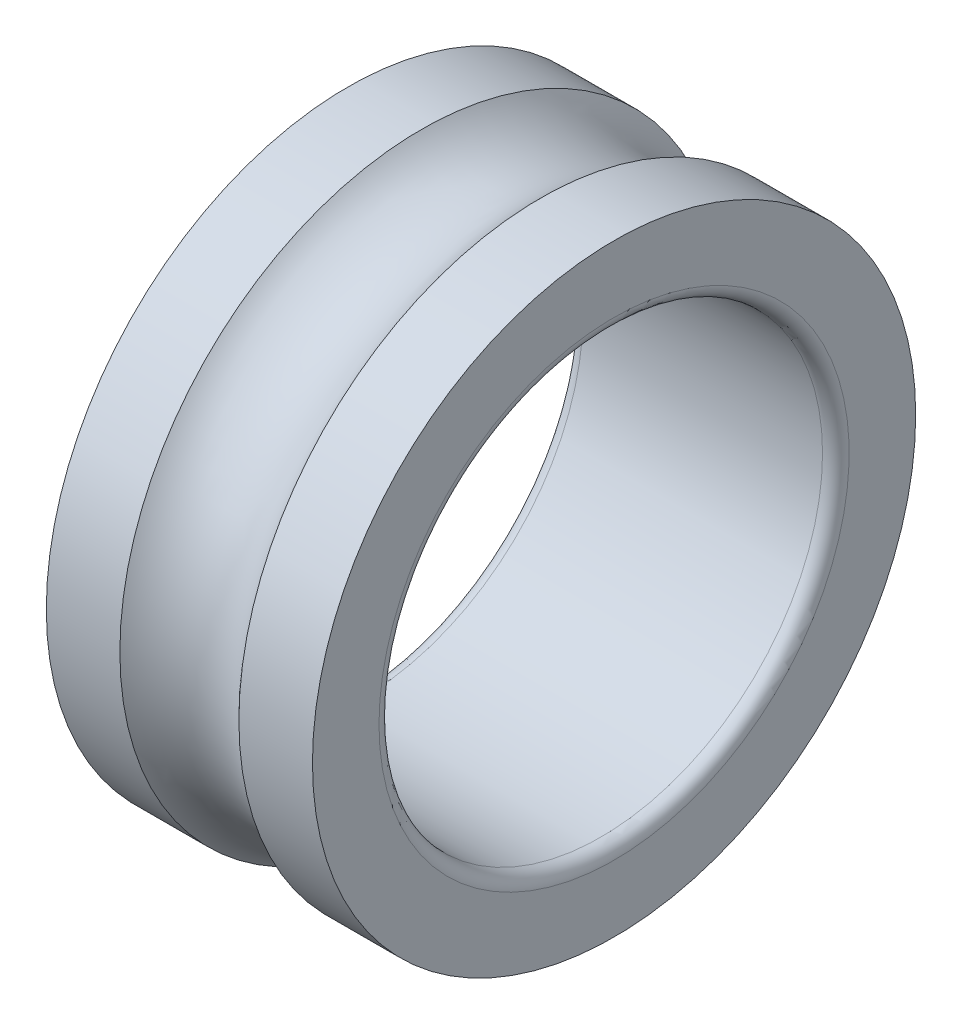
ISO-10303-21;
HEADER;
FILE_DESCRIPTION(('STEP AP214'),'2;1');
FILE_NAME('part.step','',(''),(''),'','','');
FILE_SCHEMA(('AUTOMOTIVE_DESIGN { 1 0 10303 214 1 1 1 1 }'));
ENDSEC;
DATA;
#1=APPLICATION_CONTEXT('core data for automotive mechanical design processes');
#2=APPLICATION_PROTOCOL_DEFINITION('international standard','automotive_design',2000,#1);
#3=PRODUCT_CONTEXT('',#1,'mechanical');
#4=PRODUCT('Part','Part','',(#3));
#5=PRODUCT_RELATED_PRODUCT_CATEGORY('part','',(#4));
#6=PRODUCT_DEFINITION_FORMATION('','',#4);
#7=PRODUCT_DEFINITION_CONTEXT('part definition',#1,'design');
#8=PRODUCT_DEFINITION('design','',#6,#7);
#9=PRODUCT_DEFINITION_SHAPE('','',#8);
#10=(LENGTH_UNIT() NAMED_UNIT(*) SI_UNIT(.MILLI.,.METRE.));
#11=(NAMED_UNIT(*) PLANE_ANGLE_UNIT() SI_UNIT($,.RADIAN.));
#12=(NAMED_UNIT(*) SI_UNIT($,.STERADIAN.) SOLID_ANGLE_UNIT());
#13=UNCERTAINTY_MEASURE_WITH_UNIT(LENGTH_MEASURE(1.E-05),#10,'distance_accuracy_value','');
#14=(GEOMETRIC_REPRESENTATION_CONTEXT(3) GLOBAL_UNCERTAINTY_ASSIGNED_CONTEXT((#13)) GLOBAL_UNIT_ASSIGNED_CONTEXT((#10,
#11,#12)) REPRESENTATION_CONTEXT('',''));
#15=CARTESIAN_POINT('',(0.,0.,0.));
#16=DIRECTION('',(0.,0.,1.));
#17=DIRECTION('',(1.,0.,0.));
#18=AXIS2_PLACEMENT_3D('',#15,#16,#17);
#19=CARTESIAN_POINT('',(0.150000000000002,0.,0.));
#20=DIRECTION('',(-1.,0.,0.));
#21=DIRECTION('',(0.,0.,1.));
#22=AXIS2_PLACEMENT_3D('',#19,#20,#21);
#23=TOROIDAL_SURFACE('',#22,2.65,0.150000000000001);
#24=CARTESIAN_POINT('',(0.150000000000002,0.,0.));
#25=DIRECTION('',(-1.,0.,0.));
#26=DIRECTION('',(0.,0.,1.));
#27=AXIS2_PLACEMENT_3D('',#24,#25,#26);
#28=CIRCLE('',#27,2.5);
#29=CARTESIAN_POINT('',(0.150000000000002,0.,2.5));
#30=VERTEX_POINT('',#29);
#31=EDGE_CURVE('E10',#30,#30,#28,.T.);
#32=ORIENTED_EDGE('',*,*,#31,.F.);
#33=EDGE_LOOP('',(#32));
#34=FACE_BOUND('',#33,.T.);
#35=CARTESIAN_POINT('',(0.,0.,0.));
#36=DIRECTION('',(-1.,0.,0.));
#37=DIRECTION('',(0.,0.,1.));
#38=AXIS2_PLACEMENT_3D('',#35,#36,#37);
#39=CIRCLE('',#38,2.65);
#40=CARTESIAN_POINT('',(0.,0.,2.65));
#41=VERTEX_POINT('',#40);
#42=EDGE_CURVE('E378',#41,#41,#39,.T.);
#43=ORIENTED_EDGE('',*,*,#42,.T.);
#44=EDGE_LOOP('',(#43));
#45=FACE_BOUND('',#44,.T.);
#46=ADVANCED_FACE('F350',(#34,#45),#23,.T.);
#47=CARTESIAN_POINT('',(0.,0.,0.));
#48=DIRECTION('',(-1.,0.,0.));
#49=DIRECTION('',(0.,0.,1.));
#50=AXIS2_PLACEMENT_3D('',#47,#48,#49);
#51=CYLINDRICAL_SURFACE('',#50,2.5);
#52=CARTESIAN_POINT('',(2.85,0.,0.));
#53=DIRECTION('',(-1.,0.,0.));
#54=DIRECTION('',(0.,0.,1.));
#55=AXIS2_PLACEMENT_3D('',#52,#53,#54);
#56=CIRCLE('',#55,2.5);
#57=CARTESIAN_POINT('',(2.85,0.,2.5));
#58=VERTEX_POINT('',#57);
#59=EDGE_CURVE('E356',#58,#58,#56,.T.);
#60=ORIENTED_EDGE('',*,*,#59,.F.);
#61=EDGE_LOOP('',(#60));
#62=FACE_BOUND('',#61,.T.);
#63=ORIENTED_EDGE('',*,*,#31,.T.);
#64=EDGE_LOOP('',(#63));
#65=FACE_BOUND('',#64,.T.);
#66=ADVANCED_FACE('F415',(#62,#65),#51,.F.);
#67=CARTESIAN_POINT('',(2.85,0.,0.));
#68=DIRECTION('',(-1.,0.,0.));
#69=DIRECTION('',(0.,0.,1.));
#70=AXIS2_PLACEMENT_3D('',#67,#68,#69);
#71=TOROIDAL_SURFACE('',#70,2.65,0.15);
#72=CARTESIAN_POINT('',(3.,0.,0.));
#73=DIRECTION('',(-1.,0.,0.));
#74=DIRECTION('',(0.,0.,1.));
#75=AXIS2_PLACEMENT_3D('',#72,#73,#74);
#76=CIRCLE('',#75,2.65);
#77=CARTESIAN_POINT('',(3.,0.,2.65));
#78=VERTEX_POINT('',#77);
#79=EDGE_CURVE('E360',#78,#78,#76,.T.);
#80=ORIENTED_EDGE('',*,*,#79,.F.);
#81=EDGE_LOOP('',(#80));
#82=FACE_BOUND('',#81,.T.);
#83=ORIENTED_EDGE('',*,*,#59,.T.);
#84=EDGE_LOOP('',(#83));
#85=FACE_BOUND('',#84,.T.);
#86=ADVANCED_FACE('F410',(#82,#85),#71,.T.);
#87=CARTESIAN_POINT('',(3.,0.,-3.4));
#88=DIRECTION('',(-1.,0.,0.));
#89=DIRECTION('',(0.,0.,1.));
#90=AXIS2_PLACEMENT_3D('',#87,#88,#89);
#91=PLANE('',#90);
#92=CARTESIAN_POINT('',(3.,0.,0.));
#93=DIRECTION('',(-1.,0.,0.));
#94=DIRECTION('',(0.,0.,1.));
#95=AXIS2_PLACEMENT_3D('',#92,#93,#94);
#96=CIRCLE('',#95,3.4);
#97=CARTESIAN_POINT('',(3.,0.,3.4));
#98=VERTEX_POINT('',#97);
#99=EDGE_CURVE('E364',#98,#98,#96,.T.);
#100=ORIENTED_EDGE('',*,*,#99,.F.);
#101=EDGE_LOOP('',(#100));
#102=FACE_BOUND('',#101,.T.);
#103=ORIENTED_EDGE('',*,*,#79,.T.);
#104=EDGE_LOOP('',(#103));
#105=FACE_BOUND('',#104,.T.);
#106=ADVANCED_FACE('F404',(#102,#105),#91,.F.);
#107=CARTESIAN_POINT('',(0.,0.,0.));
#108=DIRECTION('',(-1.,0.,0.));
#109=DIRECTION('',(0.,0.,1.));
#110=AXIS2_PLACEMENT_3D('',#107,#108,#109);
#111=CYLINDRICAL_SURFACE('',#110,3.4);
#112=CARTESIAN_POINT('',(2.17082039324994,0.,0.));
#113=DIRECTION('',(-1.,0.,0.));
#114=DIRECTION('',(0.,0.,1.));
#115=AXIS2_PLACEMENT_3D('',#112,#113,#114);
#116=CIRCLE('',#115,3.4);
#117=CARTESIAN_POINT('',(2.17082039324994,0.,3.4));
#118=VERTEX_POINT('',#117);
#119=EDGE_CURVE('E369',#118,#118,#116,.T.);
#120=ORIENTED_EDGE('',*,*,#119,.F.);
#121=EDGE_LOOP('',(#120));
#122=FACE_BOUND('',#121,.T.);
#123=ORIENTED_EDGE('',*,*,#99,.T.);
#124=EDGE_LOOP('',(#123));
#125=FACE_BOUND('',#124,.T.);
#126=ADVANCED_FACE('F398',(#122,#125),#111,.T.);
#127=CARTESIAN_POINT('',(1.5,0.,0.));
#128=DIRECTION('',(-1.,0.,0.));
#129=DIRECTION('',(0.,0.,1.));
#130=AXIS2_PLACEMENT_3D('',#127,#128,#129);
#131=TOROIDAL_SURFACE('',#130,4.,0.9);
#132=CARTESIAN_POINT('',(0.829179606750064,0.,0.));
#133=DIRECTION('',(-1.,0.,0.));
#134=DIRECTION('',(0.,0.,1.));
#135=AXIS2_PLACEMENT_3D('',#132,#133,#134);
#136=CIRCLE('',#135,3.4);
#137=CARTESIAN_POINT('',(0.829179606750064,0.,3.4));
#138=VERTEX_POINT('',#137);
#139=EDGE_CURVE('E372',#138,#138,#136,.T.);
#140=ORIENTED_EDGE('',*,*,#139,.F.);
#141=EDGE_LOOP('',(#140));
#142=FACE_BOUND('',#141,.T.);
#143=ORIENTED_EDGE('',*,*,#119,.T.);
#144=EDGE_LOOP('',(#143));
#145=FACE_BOUND('',#144,.T.);
#146=ADVANCED_FACE('F392',(#142,#145),#131,.F.);
#147=CARTESIAN_POINT('',(0.,0.,0.));
#148=DIRECTION('',(-1.,0.,0.));
#149=DIRECTION('',(0.,0.,1.));
#150=AXIS2_PLACEMENT_3D('',#147,#148,#149);
#151=CYLINDRICAL_SURFACE('',#150,3.4);
#152=CARTESIAN_POINT('',(0.,0.,0.));
#153=DIRECTION('',(-1.,0.,0.));
#154=DIRECTION('',(0.,0.,1.));
#155=AXIS2_PLACEMENT_3D('',#152,#153,#154);
#156=CIRCLE('',#155,3.4);
#157=CARTESIAN_POINT('',(0.,0.,3.4));
#158=VERTEX_POINT('',#157);
#159=EDGE_CURVE('E375',#158,#158,#156,.T.);
#160=ORIENTED_EDGE('',*,*,#159,.F.);
#161=EDGE_LOOP('',(#160));
#162=FACE_BOUND('',#161,.T.);
#163=ORIENTED_EDGE('',*,*,#139,.T.);
#164=EDGE_LOOP('',(#163));
#165=FACE_BOUND('',#164,.T.);
#166=ADVANCED_FACE('F386',(#162,#165),#151,.T.);
#167=CARTESIAN_POINT('',(0.,0.,-3.4));
#168=DIRECTION('',(1.,0.,0.));
#169=DIRECTION('',(0.,0.,-1.));
#170=AXIS2_PLACEMENT_3D('',#167,#168,#169);
#171=PLANE('',#170);
#172=ORIENTED_EDGE('',*,*,#42,.F.);
#173=EDGE_LOOP('',(#172));
#174=FACE_BOUND('',#173,.T.);
#175=ORIENTED_EDGE('',*,*,#159,.T.);
#176=EDGE_LOOP('',(#175));
#177=FACE_BOUND('',#176,.T.);
#178=ADVANCED_FACE('F383',(#174,#177),#171,.F.);
#179=CLOSED_SHELL('',(#46,#66,#86,#106,#126,#146,#166,#178));
#180=MANIFOLD_SOLID_BREP('B2',#179);
#181=ADVANCED_BREP_SHAPE_REPRESENTATION('',(#18,#180),#14);
#182=SHAPE_DEFINITION_REPRESENTATION(#9,#181);
ENDSEC;
END-ISO-10303-21;
